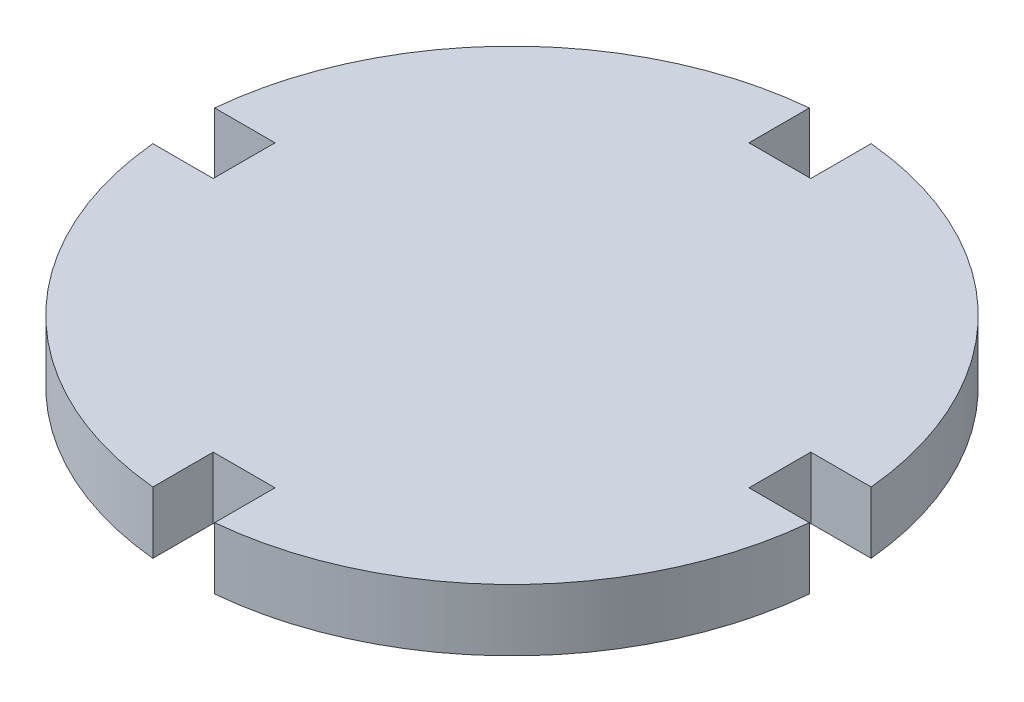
ISO-10303-21;
HEADER;
FILE_DESCRIPTION(('STEP AP214'),'2;1');
FILE_NAME('part.step','',(''),(''),'','','');
FILE_SCHEMA(('AUTOMOTIVE_DESIGN { 1 0 10303 214 1 1 1 1 }'));
ENDSEC;
DATA;
#1=APPLICATION_CONTEXT('core data for automotive mechanical design processes');
#2=APPLICATION_PROTOCOL_DEFINITION('international standard','automotive_design',2000,#1);
#3=PRODUCT_CONTEXT('',#1,'mechanical');
#4=PRODUCT('Part','Part','',(#3));
#5=PRODUCT_RELATED_PRODUCT_CATEGORY('part','',(#4));
#6=PRODUCT_DEFINITION_FORMATION('','',#4);
#7=PRODUCT_DEFINITION_CONTEXT('part definition',#1,'design');
#8=PRODUCT_DEFINITION('design','',#6,#7);
#9=PRODUCT_DEFINITION_SHAPE('','',#8);
#10=(LENGTH_UNIT() NAMED_UNIT(*) SI_UNIT(.MILLI.,.METRE.));
#11=(NAMED_UNIT(*) PLANE_ANGLE_UNIT() SI_UNIT($,.RADIAN.));
#12=(NAMED_UNIT(*) SI_UNIT($,.STERADIAN.) SOLID_ANGLE_UNIT());
#13=UNCERTAINTY_MEASURE_WITH_UNIT(LENGTH_MEASURE(1.E-05),#10,'distance_accuracy_value','');
#14=(GEOMETRIC_REPRESENTATION_CONTEXT(3) GLOBAL_UNCERTAINTY_ASSIGNED_CONTEXT((#13)) GLOBAL_UNIT_ASSIGNED_CONTEXT((#10,
#11,#12)) REPRESENTATION_CONTEXT('',''));
#15=CARTESIAN_POINT('',(0.,0.,0.));
#16=DIRECTION('',(0.,0.,1.));
#17=DIRECTION('',(1.,0.,0.));
#18=AXIS2_PLACEMENT_3D('',#15,#16,#17);
#19=CARTESIAN_POINT('',(0.,3.,0.));
#20=DIRECTION('',(0.,-1.,0.));
#21=DIRECTION('',(0.,0.,-1.));
#22=AXIS2_PLACEMENT_3D('',#19,#20,#21);
#23=CYLINDRICAL_SURFACE('',#22,16.);
#24=CARTESIAN_POINT('',(0.,3.,0.));
#25=DIRECTION('',(0.,1.,0.));
#26=DIRECTION('',(0.,0.,1.));
#27=AXIS2_PLACEMENT_3D('',#24,#25,#26);
#28=CIRCLE('',#27,16.);
#29=CARTESIAN_POINT('',(15.929532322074,3.,-1.50000000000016));
#30=VERTEX_POINT('',#29);
#31=CARTESIAN_POINT('',(1.5,3.,-15.929532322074));
#32=VERTEX_POINT('',#31);
#33=EDGE_CURVE('E183',#30,#32,#28,.T.);
#34=ORIENTED_EDGE('',*,*,#33,.F.);
#35=DIRECTION('',(0.,-1.,0.));
#36=VECTOR('',#35,1.);
#37=CARTESIAN_POINT('',(15.929532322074,3.,-1.50000000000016));
#38=LINE('',#37,#36);
#39=CARTESIAN_POINT('',(15.929532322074,0.,-1.50000000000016));
#40=VERTEX_POINT('',#39);
#41=EDGE_CURVE('E218',#30,#40,#38,.T.);
#42=ORIENTED_EDGE('',*,*,#41,.T.);
#43=CARTESIAN_POINT('',(0.,0.,0.));
#44=DIRECTION('',(0.,1.,0.));
#45=DIRECTION('',(0.,0.,1.));
#46=AXIS2_PLACEMENT_3D('',#43,#44,#45);
#47=CIRCLE('',#46,16.);
#48=CARTESIAN_POINT('',(1.5,0.,-15.929532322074));
#49=VERTEX_POINT('',#48);
#50=EDGE_CURVE('E165',#40,#49,#47,.T.);
#51=ORIENTED_EDGE('',*,*,#50,.T.);
#52=DIRECTION('',(0.,-1.,0.));
#53=VECTOR('',#52,1.);
#54=CARTESIAN_POINT('',(1.5,3.,-15.929532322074));
#55=LINE('',#54,#53);
#56=EDGE_CURVE('E178',#49,#32,#55,.F.);
#57=ORIENTED_EDGE('',*,*,#56,.T.);
#58=EDGE_LOOP('',(#34,#42,#51,#57));
#59=FACE_BOUND('',#58,.T.);
#60=ADVANCED_FACE('F33',(#59),#23,.T.);
#61=CARTESIAN_POINT('',(1.5,0.,15.929532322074));
#62=VERTEX_POINT('',#61);
#63=CARTESIAN_POINT('',(15.929532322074,0.,1.49999999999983));
#64=VERTEX_POINT('',#63);
#65=EDGE_CURVE('E171',#62,#64,#47,.T.);
#66=ORIENTED_EDGE('',*,*,#65,.T.);
#67=DIRECTION('',(0.,-1.,0.));
#68=VECTOR('',#67,1.);
#69=CARTESIAN_POINT('',(15.929532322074,3.,1.49999999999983));
#70=LINE('',#69,#68);
#71=CARTESIAN_POINT('',(15.929532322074,3.,1.49999999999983));
#72=VERTEX_POINT('',#71);
#73=EDGE_CURVE('E283',#64,#72,#70,.F.);
#74=ORIENTED_EDGE('',*,*,#73,.T.);
#75=CARTESIAN_POINT('',(1.5,3.,15.929532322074));
#76=VERTEX_POINT('',#75);
#77=EDGE_CURVE('E187',#76,#72,#28,.T.);
#78=ORIENTED_EDGE('',*,*,#77,.F.);
#79=DIRECTION('',(0.,-1.,0.));
#80=VECTOR('',#79,1.);
#81=CARTESIAN_POINT('',(1.5,3.,15.929532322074));
#82=LINE('',#81,#80);
#83=EDGE_CURVE('E224',#76,#62,#82,.T.);
#84=ORIENTED_EDGE('',*,*,#83,.T.);
#85=EDGE_LOOP('',(#66,#74,#78,#84));
#86=FACE_BOUND('',#85,.T.);
#87=ADVANCED_FACE('F281',(#86),#23,.T.);
#88=CARTESIAN_POINT('',(-15.929532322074,0.,1.50000000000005));
#89=VERTEX_POINT('',#88);
#90=CARTESIAN_POINT('',(-1.5,0.,15.929532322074));
#91=VERTEX_POINT('',#90);
#92=EDGE_CURVE('E176',#89,#91,#47,.T.);
#93=ORIENTED_EDGE('',*,*,#92,.T.);
#94=DIRECTION('',(0.,-1.,0.));
#95=VECTOR('',#94,1.);
#96=CARTESIAN_POINT('',(-1.5,3.,15.929532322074));
#97=LINE('',#96,#95);
#98=CARTESIAN_POINT('',(-1.5,3.,15.929532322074));
#99=VERTEX_POINT('',#98);
#100=EDGE_CURVE('E196',#91,#99,#97,.F.);
#101=ORIENTED_EDGE('',*,*,#100,.T.);
#102=CARTESIAN_POINT('',(-15.929532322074,3.,1.50000000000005));
#103=VERTEX_POINT('',#102);
#104=EDGE_CURVE('E265',#103,#99,#28,.T.);
#105=ORIENTED_EDGE('',*,*,#104,.F.);
#106=DIRECTION('',(0.,-1.,0.));
#107=VECTOR('',#106,1.);
#108=CARTESIAN_POINT('',(-15.929532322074,3.,1.50000000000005));
#109=LINE('',#108,#107);
#110=EDGE_CURVE('E198',#103,#89,#109,.T.);
#111=ORIENTED_EDGE('',*,*,#110,.T.);
#112=EDGE_LOOP('',(#93,#101,#105,#111));
#113=FACE_BOUND('',#112,.T.);
#114=ADVANCED_FACE('F194',(#113),#23,.T.);
#115=CARTESIAN_POINT('',(-1.5,0.,-15.929532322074));
#116=VERTEX_POINT('',#115);
#117=CARTESIAN_POINT('',(-15.929532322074,0.,-1.49999999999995));
#118=VERTEX_POINT('',#117);
#119=EDGE_CURVE('E174',#116,#118,#47,.T.);
#120=ORIENTED_EDGE('',*,*,#119,.T.);
#121=DIRECTION('',(0.,-1.,0.));
#122=VECTOR('',#121,1.);
#123=CARTESIAN_POINT('',(-15.929532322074,3.,-1.49999999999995));
#124=LINE('',#123,#122);
#125=CARTESIAN_POINT('',(-15.929532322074,3.,-1.49999999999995));
#126=VERTEX_POINT('',#125);
#127=EDGE_CURVE('E242',#118,#126,#124,.F.);
#128=ORIENTED_EDGE('',*,*,#127,.T.);
#129=CARTESIAN_POINT('',(-1.5,3.,-15.929532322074));
#130=VERTEX_POINT('',#129);
#131=EDGE_CURVE('E188',#130,#126,#28,.T.);
#132=ORIENTED_EDGE('',*,*,#131,.F.);
#133=DIRECTION('',(0.,-1.,0.));
#134=VECTOR('',#133,1.);
#135=CARTESIAN_POINT('',(-1.5,3.,-15.929532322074));
#136=LINE('',#135,#134);
#137=EDGE_CURVE('E172',#130,#116,#136,.T.);
#138=ORIENTED_EDGE('',*,*,#137,.T.);
#139=EDGE_LOOP('',(#120,#128,#132,#138));
#140=FACE_BOUND('',#139,.T.);
#141=ADVANCED_FACE('F35',(#140),#23,.T.);
#142=CARTESIAN_POINT('',(0.,3.,0.));
#143=DIRECTION('',(0.,1.,0.));
#144=DIRECTION('',(0.,0.,1.));
#145=AXIS2_PLACEMENT_3D('',#142,#143,#144);
#146=PLANE('',#145);
#147=DIRECTION('',(-1.,0.,0.));
#148=VECTOR('',#147,1.);
#149=CARTESIAN_POINT('',(19.,3.,-1.5000000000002));
#150=LINE('',#149,#148);
#151=CARTESIAN_POINT('',(13.,3.,-1.50000000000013));
#152=VERTEX_POINT('',#151);
#153=EDGE_CURVE('E150',#30,#152,#150,.T.);
#154=ORIENTED_EDGE('',*,*,#153,.F.);
#155=ORIENTED_EDGE('',*,*,#33,.T.);
#156=DIRECTION('',(0.,0.,-1.));
#157=VECTOR('',#156,1.);
#158=CARTESIAN_POINT('',(1.5,3.,-19.));
#159=LINE('',#158,#157);
#160=CARTESIAN_POINT('',(1.5,3.,-13.));
#161=VERTEX_POINT('',#160);
#162=EDGE_CURVE('E250',#161,#32,#159,.T.);
#163=ORIENTED_EDGE('',*,*,#162,.F.);
#164=DIRECTION('',(1.,0.,0.));
#165=VECTOR('',#164,1.);
#166=CARTESIAN_POINT('',(1.5,3.,-13.));
#167=LINE('',#166,#165);
#168=CARTESIAN_POINT('',(-1.5,3.,-13.));
#169=VERTEX_POINT('',#168);
#170=EDGE_CURVE('E254',#169,#161,#167,.T.);
#171=ORIENTED_EDGE('',*,*,#170,.F.);
#172=DIRECTION('',(0.,0.,1.));
#173=VECTOR('',#172,1.);
#174=CARTESIAN_POINT('',(-1.5,3.,-19.));
#175=LINE('',#174,#173);
#176=EDGE_CURVE('E247',#130,#169,#175,.T.);
#177=ORIENTED_EDGE('',*,*,#176,.F.);
#178=ORIENTED_EDGE('',*,*,#131,.T.);
#179=DIRECTION('',(-1.,0.,0.));
#180=VECTOR('',#179,1.);
#181=CARTESIAN_POINT('',(-19.,3.,-1.49999999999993));
#182=LINE('',#181,#180);
#183=CARTESIAN_POINT('',(-13.,3.,-1.49999999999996));
#184=VERTEX_POINT('',#183);
#185=EDGE_CURVE('E231',#184,#126,#182,.T.);
#186=ORIENTED_EDGE('',*,*,#185,.F.);
#187=DIRECTION('',(0.,0.,-1.));
#188=VECTOR('',#187,1.);
#189=CARTESIAN_POINT('',(-13.,3.,-1.49999999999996));
#190=LINE('',#189,#188);
#191=CARTESIAN_POINT('',(-13.,3.,1.50000000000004));
#192=VERTEX_POINT('',#191);
#193=EDGE_CURVE('E236',#192,#184,#190,.T.);
#194=ORIENTED_EDGE('',*,*,#193,.F.);
#195=DIRECTION('',(1.,0.,0.));
#196=VECTOR('',#195,1.);
#197=CARTESIAN_POINT('',(-19.,3.,1.50000000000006));
#198=LINE('',#197,#196);
#199=EDGE_CURVE('E227',#103,#192,#198,.T.);
#200=ORIENTED_EDGE('',*,*,#199,.F.);
#201=ORIENTED_EDGE('',*,*,#104,.T.);
#202=DIRECTION('',(0.,0.,1.));
#203=VECTOR('',#202,1.);
#204=CARTESIAN_POINT('',(-1.5,3.,19.));
#205=LINE('',#204,#203);
#206=CARTESIAN_POINT('',(-1.5,3.,13.));
#207=VERTEX_POINT('',#206);
#208=EDGE_CURVE('E211',#207,#99,#205,.T.);
#209=ORIENTED_EDGE('',*,*,#208,.F.);
#210=DIRECTION('',(-1.,0.,0.));
#211=VECTOR('',#210,1.);
#212=CARTESIAN_POINT('',(-1.5,3.,13.));
#213=LINE('',#212,#211);
#214=CARTESIAN_POINT('',(1.5,3.,13.));
#215=VERTEX_POINT('',#214);
#216=EDGE_CURVE('E217',#215,#207,#213,.T.);
#217=ORIENTED_EDGE('',*,*,#216,.F.);
#218=DIRECTION('',(0.,0.,-1.));
#219=VECTOR('',#218,1.);
#220=CARTESIAN_POINT('',(1.5,3.,19.));
#221=LINE('',#220,#219);
#222=EDGE_CURVE('E215',#76,#215,#221,.T.);
#223=ORIENTED_EDGE('',*,*,#222,.F.);
#224=ORIENTED_EDGE('',*,*,#77,.T.);
#225=DIRECTION('',(1.,0.,0.));
#226=VECTOR('',#225,1.);
#227=CARTESIAN_POINT('',(19.,3.,1.4999999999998));
#228=LINE('',#227,#226);
#229=CARTESIAN_POINT('',(13.,3.,1.49999999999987));
#230=VERTEX_POINT('',#229);
#231=EDGE_CURVE('E160',#230,#72,#228,.T.);
#232=ORIENTED_EDGE('',*,*,#231,.F.);
#233=DIRECTION('',(0.,0.,1.));
#234=VECTOR('',#233,1.);
#235=CARTESIAN_POINT('',(13.,3.,1.49999999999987));
#236=LINE('',#235,#234);
#237=EDGE_CURVE('E288',#152,#230,#236,.T.);
#238=ORIENTED_EDGE('',*,*,#237,.F.);
#239=EDGE_LOOP('',(#154,#155,#163,#171,#177,#178,#186,#194,#200,#201,#209,#217,#223,#224,#232,#238));
#240=FACE_BOUND('',#239,.T.);
#241=ADVANCED_FACE('F277',(#240),#146,.T.);
#242=CARTESIAN_POINT('',(0.,0.,0.));
#243=DIRECTION('',(0.,1.,0.));
#244=DIRECTION('',(0.,0.,1.));
#245=AXIS2_PLACEMENT_3D('',#242,#243,#244);
#246=PLANE('',#245);
#247=ORIENTED_EDGE('',*,*,#50,.F.);
#248=DIRECTION('',(-1.,0.,0.));
#249=VECTOR('',#248,1.);
#250=CARTESIAN_POINT('',(0.,0.,-1.5));
#251=LINE('',#250,#249);
#252=CARTESIAN_POINT('',(13.,0.,-1.50000000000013));
#253=VERTEX_POINT('',#252);
#254=EDGE_CURVE('E11',#40,#253,#251,.T.);
#255=ORIENTED_EDGE('',*,*,#254,.T.);
#256=DIRECTION('',(0.,0.,1.));
#257=VECTOR('',#256,1.);
#258=CARTESIAN_POINT('',(13.,0.,1.49999999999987));
#259=LINE('',#258,#257);
#260=CARTESIAN_POINT('',(13.,0.,1.49999999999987));
#261=VERTEX_POINT('',#260);
#262=EDGE_CURVE('E157',#253,#261,#259,.T.);
#263=ORIENTED_EDGE('',*,*,#262,.T.);
#264=DIRECTION('',(1.,0.,0.));
#265=VECTOR('',#264,1.);
#266=CARTESIAN_POINT('',(19.,0.,1.4999999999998));
#267=LINE('',#266,#265);
#268=EDGE_CURVE('E48',#261,#64,#267,.T.);
#269=ORIENTED_EDGE('',*,*,#268,.T.);
#270=ORIENTED_EDGE('',*,*,#65,.F.);
#271=DIRECTION('',(0.,0.,-1.));
#272=VECTOR('',#271,1.);
#273=CARTESIAN_POINT('',(1.5,0.,0.));
#274=LINE('',#273,#272);
#275=CARTESIAN_POINT('',(1.5,0.,13.));
#276=VERTEX_POINT('',#275);
#277=EDGE_CURVE('E41',#62,#276,#274,.T.);
#278=ORIENTED_EDGE('',*,*,#277,.T.);
#279=DIRECTION('',(-1.,0.,0.));
#280=VECTOR('',#279,1.);
#281=CARTESIAN_POINT('',(-1.5,0.,13.));
#282=LINE('',#281,#280);
#283=CARTESIAN_POINT('',(-1.5,0.,13.));
#284=VERTEX_POINT('',#283);
#285=EDGE_CURVE('E205',#276,#284,#282,.T.);
#286=ORIENTED_EDGE('',*,*,#285,.T.);
#287=DIRECTION('',(0.,0.,1.));
#288=VECTOR('',#287,1.);
#289=CARTESIAN_POINT('',(-1.5,0.,19.));
#290=LINE('',#289,#288);
#291=EDGE_CURVE('E56',#284,#91,#290,.T.);
#292=ORIENTED_EDGE('',*,*,#291,.T.);
#293=ORIENTED_EDGE('',*,*,#92,.F.);
#294=DIRECTION('',(1.,0.,0.));
#295=VECTOR('',#294,1.);
#296=CARTESIAN_POINT('',(0.,0.,1.5));
#297=LINE('',#296,#295);
#298=CARTESIAN_POINT('',(-13.,0.,1.50000000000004));
#299=VERTEX_POINT('',#298);
#300=EDGE_CURVE('E201',#89,#299,#297,.T.);
#301=ORIENTED_EDGE('',*,*,#300,.T.);
#302=DIRECTION('',(0.,0.,-1.));
#303=VECTOR('',#302,1.);
#304=CARTESIAN_POINT('',(-13.,0.,-1.49999999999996));
#305=LINE('',#304,#303);
#306=CARTESIAN_POINT('',(-13.,0.,-1.49999999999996));
#307=VERTEX_POINT('',#306);
#308=EDGE_CURVE('E228',#299,#307,#305,.T.);
#309=ORIENTED_EDGE('',*,*,#308,.T.);
#310=DIRECTION('',(-1.,0.,0.));
#311=VECTOR('',#310,1.);
#312=CARTESIAN_POINT('',(-19.,0.,-1.49999999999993));
#313=LINE('',#312,#311);
#314=EDGE_CURVE('E230',#307,#118,#313,.T.);
#315=ORIENTED_EDGE('',*,*,#314,.T.);
#316=ORIENTED_EDGE('',*,*,#119,.F.);
#317=DIRECTION('',(0.,0.,1.));
#318=VECTOR('',#317,1.);
#319=CARTESIAN_POINT('',(-1.5,0.,0.));
#320=LINE('',#319,#318);
#321=CARTESIAN_POINT('',(-1.5,0.,-13.));
#322=VERTEX_POINT('',#321);
#323=EDGE_CURVE('E264',#116,#322,#320,.T.);
#324=ORIENTED_EDGE('',*,*,#323,.T.);
#325=DIRECTION('',(1.,0.,0.));
#326=VECTOR('',#325,1.);
#327=CARTESIAN_POINT('',(1.5,0.,-13.));
#328=LINE('',#327,#326);
#329=CARTESIAN_POINT('',(1.5,0.,-13.));
#330=VERTEX_POINT('',#329);
#331=EDGE_CURVE('E248',#322,#330,#328,.T.);
#332=ORIENTED_EDGE('',*,*,#331,.T.);
#333=DIRECTION('',(0.,0.,-1.));
#334=VECTOR('',#333,1.);
#335=CARTESIAN_POINT('',(1.5,0.,-19.));
#336=LINE('',#335,#334);
#337=EDGE_CURVE('E167',#330,#49,#336,.T.);
#338=ORIENTED_EDGE('',*,*,#337,.T.);
#339=EDGE_LOOP('',(#247,#255,#263,#269,#270,#278,#286,#292,#293,#301,#309,#315,#316,#324,#332,#338));
#340=FACE_BOUND('',#339,.T.);
#341=ADVANCED_FACE('F163',(#340),#246,.F.);
#342=CARTESIAN_POINT('',(-1.5,0.,-19.));
#343=DIRECTION('',(-1.,0.,0.));
#344=DIRECTION('',(0.,0.,1.));
#345=AXIS2_PLACEMENT_3D('',#342,#343,#344);
#346=PLANE('',#345);
#347=ORIENTED_EDGE('',*,*,#176,.T.);
#348=DIRECTION('',(0.,1.,0.));
#349=VECTOR('',#348,1.);
#350=CARTESIAN_POINT('',(-1.5,0.,-13.));
#351=LINE('',#350,#349);
#352=EDGE_CURVE('E252',#322,#169,#351,.T.);
#353=ORIENTED_EDGE('',*,*,#352,.F.);
#354=ORIENTED_EDGE('',*,*,#323,.F.);
#355=ORIENTED_EDGE('',*,*,#137,.F.);
#356=EDGE_LOOP('',(#347,#353,#354,#355));
#357=FACE_BOUND('',#356,.T.);
#358=ADVANCED_FACE('F351',(#357),#346,.F.);
#359=CARTESIAN_POINT('',(1.5,0.,-19.));
#360=DIRECTION('',(1.,0.,0.));
#361=DIRECTION('',(0.,0.,-1.));
#362=AXIS2_PLACEMENT_3D('',#359,#360,#361);
#363=PLANE('',#362);
#364=ORIENTED_EDGE('',*,*,#337,.F.);
#365=DIRECTION('',(0.,1.,0.));
#366=VECTOR('',#365,1.);
#367=CARTESIAN_POINT('',(1.5,0.,-13.));
#368=LINE('',#367,#366);
#369=EDGE_CURVE('E259',#330,#161,#368,.T.);
#370=ORIENTED_EDGE('',*,*,#369,.T.);
#371=ORIENTED_EDGE('',*,*,#162,.T.);
#372=ORIENTED_EDGE('',*,*,#56,.F.);
#373=EDGE_LOOP('',(#364,#370,#371,#372));
#374=FACE_BOUND('',#373,.T.);
#375=ADVANCED_FACE('F340',(#374),#363,.F.);
#376=CARTESIAN_POINT('',(1.5,0.,-13.));
#377=DIRECTION('',(0.,0.,1.));
#378=DIRECTION('',(1.,0.,0.));
#379=AXIS2_PLACEMENT_3D('',#376,#377,#378);
#380=PLANE('',#379);
#381=ORIENTED_EDGE('',*,*,#170,.T.);
#382=ORIENTED_EDGE('',*,*,#369,.F.);
#383=ORIENTED_EDGE('',*,*,#331,.F.);
#384=ORIENTED_EDGE('',*,*,#352,.T.);
#385=EDGE_LOOP('',(#381,#382,#383,#384));
#386=FACE_BOUND('',#385,.T.);
#387=ADVANCED_FACE('F334',(#386),#380,.F.);
#388=CARTESIAN_POINT('',(-19.,0.,1.50000000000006));
#389=DIRECTION('',(0.,0.,1.));
#390=DIRECTION('',(1.,0.,0.));
#391=AXIS2_PLACEMENT_3D('',#388,#389,#390);
#392=PLANE('',#391);
#393=ORIENTED_EDGE('',*,*,#199,.T.);
#394=DIRECTION('',(0.,1.,0.));
#395=VECTOR('',#394,1.);
#396=CARTESIAN_POINT('',(-13.,0.,1.50000000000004));
#397=LINE('',#396,#395);
#398=EDGE_CURVE('E234',#299,#192,#397,.T.);
#399=ORIENTED_EDGE('',*,*,#398,.F.);
#400=ORIENTED_EDGE('',*,*,#300,.F.);
#401=ORIENTED_EDGE('',*,*,#110,.F.);
#402=EDGE_LOOP('',(#393,#399,#400,#401));
#403=FACE_BOUND('',#402,.T.);
#404=ADVANCED_FACE('F339',(#403),#392,.F.);
#405=CARTESIAN_POINT('',(-19.,0.,-1.49999999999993));
#406=DIRECTION('',(0.,0.,-1.));
#407=DIRECTION('',(-1.,0.,0.));
#408=AXIS2_PLACEMENT_3D('',#405,#406,#407);
#409=PLANE('',#408);
#410=ORIENTED_EDGE('',*,*,#314,.F.);
#411=DIRECTION('',(0.,1.,0.));
#412=VECTOR('',#411,1.);
#413=CARTESIAN_POINT('',(-13.,0.,-1.49999999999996));
#414=LINE('',#413,#412);
#415=EDGE_CURVE('E240',#307,#184,#414,.T.);
#416=ORIENTED_EDGE('',*,*,#415,.T.);
#417=ORIENTED_EDGE('',*,*,#185,.T.);
#418=ORIENTED_EDGE('',*,*,#127,.F.);
#419=EDGE_LOOP('',(#410,#416,#417,#418));
#420=FACE_BOUND('',#419,.T.);
#421=ADVANCED_FACE('F385',(#420),#409,.F.);
#422=CARTESIAN_POINT('',(-13.,0.,-1.49999999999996));
#423=DIRECTION('',(1.,0.,0.));
#424=DIRECTION('',(0.,0.,-1.));
#425=AXIS2_PLACEMENT_3D('',#422,#423,#424);
#426=PLANE('',#425);
#427=ORIENTED_EDGE('',*,*,#193,.T.);
#428=ORIENTED_EDGE('',*,*,#415,.F.);
#429=ORIENTED_EDGE('',*,*,#308,.F.);
#430=ORIENTED_EDGE('',*,*,#398,.T.);
#431=EDGE_LOOP('',(#427,#428,#429,#430));
#432=FACE_BOUND('',#431,.T.);
#433=ADVANCED_FACE('F304',(#432),#426,.F.);
#434=CARTESIAN_POINT('',(1.5,0.,19.));
#435=DIRECTION('',(1.,0.,0.));
#436=DIRECTION('',(0.,0.,-1.));
#437=AXIS2_PLACEMENT_3D('',#434,#435,#436);
#438=PLANE('',#437);
#439=ORIENTED_EDGE('',*,*,#222,.T.);
#440=DIRECTION('',(0.,1.,0.));
#441=VECTOR('',#440,1.);
#442=CARTESIAN_POINT('',(1.5,0.,13.));
#443=LINE('',#442,#441);
#444=EDGE_CURVE('E206',#276,#215,#443,.T.);
#445=ORIENTED_EDGE('',*,*,#444,.F.);
#446=ORIENTED_EDGE('',*,*,#277,.F.);
#447=ORIENTED_EDGE('',*,*,#83,.F.);
#448=EDGE_LOOP('',(#439,#445,#446,#447));
#449=FACE_BOUND('',#448,.T.);
#450=ADVANCED_FACE('F293',(#449),#438,.F.);
#451=CARTESIAN_POINT('',(-1.5,0.,19.));
#452=DIRECTION('',(-1.,0.,0.));
#453=DIRECTION('',(0.,0.,1.));
#454=AXIS2_PLACEMENT_3D('',#451,#452,#453);
#455=PLANE('',#454);
#456=ORIENTED_EDGE('',*,*,#291,.F.);
#457=DIRECTION('',(0.,1.,0.));
#458=VECTOR('',#457,1.);
#459=CARTESIAN_POINT('',(-1.5,0.,13.));
#460=LINE('',#459,#458);
#461=EDGE_CURVE('E209',#284,#207,#460,.T.);
#462=ORIENTED_EDGE('',*,*,#461,.T.);
#463=ORIENTED_EDGE('',*,*,#208,.T.);
#464=ORIENTED_EDGE('',*,*,#100,.F.);
#465=EDGE_LOOP('',(#456,#462,#463,#464));
#466=FACE_BOUND('',#465,.T.);
#467=ADVANCED_FACE('F296',(#466),#455,.F.);
#468=CARTESIAN_POINT('',(-1.5,0.,13.));
#469=DIRECTION('',(0.,0.,-1.));
#470=DIRECTION('',(-1.,0.,0.));
#471=AXIS2_PLACEMENT_3D('',#468,#469,#470);
#472=PLANE('',#471);
#473=ORIENTED_EDGE('',*,*,#216,.T.);
#474=ORIENTED_EDGE('',*,*,#461,.F.);
#475=ORIENTED_EDGE('',*,*,#285,.F.);
#476=ORIENTED_EDGE('',*,*,#444,.T.);
#477=EDGE_LOOP('',(#473,#474,#475,#476));
#478=FACE_BOUND('',#477,.T.);
#479=ADVANCED_FACE('F295',(#478),#472,.F.);
#480=CARTESIAN_POINT('',(19.,0.,-1.5000000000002));
#481=DIRECTION('',(0.,0.,-1.));
#482=DIRECTION('',(-1.,0.,0.));
#483=AXIS2_PLACEMENT_3D('',#480,#481,#482);
#484=PLANE('',#483);
#485=ORIENTED_EDGE('',*,*,#153,.T.);
#486=DIRECTION('',(0.,1.,0.));
#487=VECTOR('',#486,1.);
#488=CARTESIAN_POINT('',(13.,0.,-1.50000000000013));
#489=LINE('',#488,#487);
#490=EDGE_CURVE('E145',#253,#152,#489,.T.);
#491=ORIENTED_EDGE('',*,*,#490,.F.);
#492=ORIENTED_EDGE('',*,*,#254,.F.);
#493=ORIENTED_EDGE('',*,*,#41,.F.);
#494=EDGE_LOOP('',(#485,#491,#492,#493));
#495=FACE_BOUND('',#494,.T.);
#496=ADVANCED_FACE('F147',(#495),#484,.F.);
#497=CARTESIAN_POINT('',(19.,0.,1.4999999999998));
#498=DIRECTION('',(0.,0.,1.));
#499=DIRECTION('',(1.,0.,0.));
#500=AXIS2_PLACEMENT_3D('',#497,#498,#499);
#501=PLANE('',#500);
#502=ORIENTED_EDGE('',*,*,#268,.F.);
#503=DIRECTION('',(0.,1.,0.));
#504=VECTOR('',#503,1.);
#505=CARTESIAN_POINT('',(13.,0.,1.49999999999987));
#506=LINE('',#505,#504);
#507=EDGE_CURVE('E154',#261,#230,#506,.T.);
#508=ORIENTED_EDGE('',*,*,#507,.T.);
#509=ORIENTED_EDGE('',*,*,#231,.T.);
#510=ORIENTED_EDGE('',*,*,#73,.F.);
#511=EDGE_LOOP('',(#502,#508,#509,#510));
#512=FACE_BOUND('',#511,.T.);
#513=ADVANCED_FACE('F429',(#512),#501,.F.);
#514=CARTESIAN_POINT('',(13.,0.,1.49999999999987));
#515=DIRECTION('',(-1.,0.,0.));
#516=DIRECTION('',(0.,0.,1.));
#517=AXIS2_PLACEMENT_3D('',#514,#515,#516);
#518=PLANE('',#517);
#519=ORIENTED_EDGE('',*,*,#237,.T.);
#520=ORIENTED_EDGE('',*,*,#507,.F.);
#521=ORIENTED_EDGE('',*,*,#262,.F.);
#522=ORIENTED_EDGE('',*,*,#490,.T.);
#523=EDGE_LOOP('',(#519,#520,#521,#522));
#524=FACE_BOUND('',#523,.T.);
#525=ADVANCED_FACE('F158',(#524),#518,.F.);
#526=CLOSED_SHELL('',(#60,#87,#114,#141,#241,#341,#358,#375,#387,#404,#421,#433,#450,#467,#479,
#496,#513,#525));
#527=MANIFOLD_SOLID_BREP('B2',#526);
#528=ADVANCED_BREP_SHAPE_REPRESENTATION('',(#18,#527),#14);
#529=SHAPE_DEFINITION_REPRESENTATION(#9,#528);
ENDSEC;
END-ISO-10303-21;
